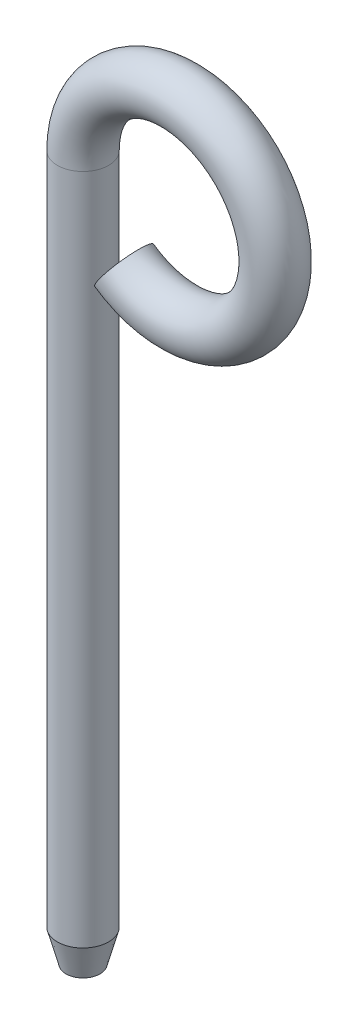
from build123d import *

# Parameters (mm, degrees)
ESQUISSE2_R      = 4
CHANFREIN1_SIZE  = 5
CHANFREIN1_SIZE2 = 1.339745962


with BuildPart() as part:
    # Balayage1: sweep along a path in Esquisse1
    with BuildLine(Plane.XY) as balayage1_path:
        Line((0, 0), (0, 110))
        ThreePointArc((0, 110), (28.305162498, 116.926229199), (6.396353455, 97.712719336))
    # Esquisse2 → Balayage1 (sweep)
    with BuildSketch(Plane(origin=(0, 0, 0), x_dir=(1, 0, 0), z_dir=(0, 1, 0))):
        Circle(ESQUISSE2_R)
    sweep(path=balayage1_path.line)

    # Chanfrein1
    chanfrein1_edges = [part.edges().sort_by_distance(p)[0] for p in [
        (-4, 0, 0),
    ]]
    chanfrein1_side = [part.faces().sort_by_distance(p)[0] for p in [
        (-4, 55, 0),
    ]]
    chamfer(chanfrein1_edges, length=CHANFREIN1_SIZE, length2=CHANFREIN1_SIZE2, reference=chanfrein1_side[0])


solid = part.part
